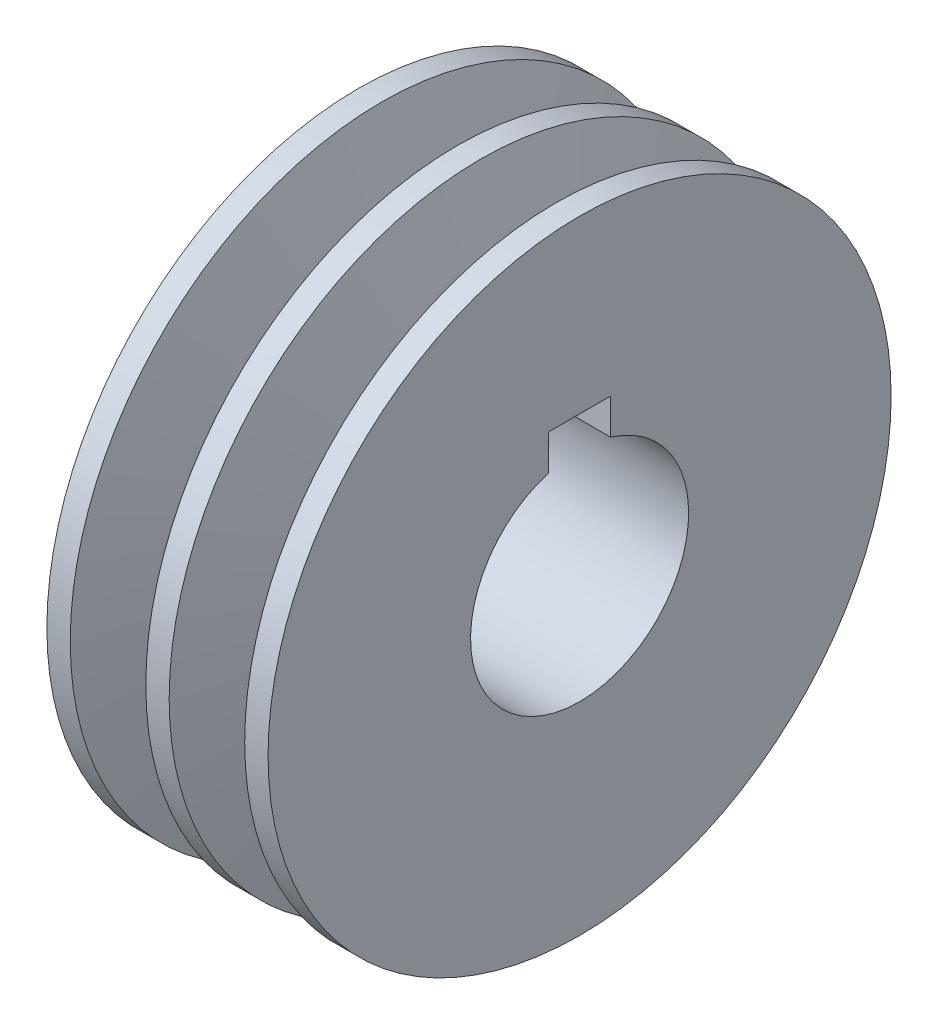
from build123d import *

# Parameters (mm, degrees)
SCHNITT_LINEAR_AUSTRAGEN1_DEPTH = 64.297393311


with BuildPart() as part:
    # Skizze1 → Rotation1 (revolve)
    with BuildSketch(Plane.XY, mode=Mode.PRIVATE) as rotation1_sk:
        Polygon((0, 0), (0, 40), (3, 40), (6.116600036, 27.5), (9.583399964, 27.5), (12.7, 40), (15.7, 40), (18.816600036, 27.5), (22.283399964, 27.5), (25.4, 40), (28.4, 40), (28.4, 0), align=None)
    revolve(rotation1_sk.sketch.rotate(Axis((0, 0, 0), (1, 0, 0)), 90), axis=Axis((0, 0, 0), (1, 0, 0)))

    # Skizze2 → Schnitt-Linear austragen1 (cut, through all)
    with BuildSketch(Plane(origin=(28.4, 0, 0), x_dir=(0, 0, -1), z_dir=(1, 0, 0))):
        with BuildLine():
            ThreePointArc((4, 13.416407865), (0, 14), (-4, 13.416407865))
            Line((-4, 13.416407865), (4, 13.416407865))
        make_face()
        with BuildLine():
            Line((4, 13.416407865), (-4, 13.416407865))
            ThreePointArc((-4, 13.416407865), (-8.366600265, -11.22497216), (14, 0))
            ThreePointArc((14, 0), (11.22497216, 8.366600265), (4, 13.416407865))
        make_face()
        with BuildLine():
            Line((-4, 18), (-4, 13.416407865))
            ThreePointArc((-4, 13.416407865), (0, 14), (4, 13.416407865))
            Line((4, 13.416407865), (4, 18))
            Line((4, 18), (-4, 18))
        make_face()
        with BuildLine():
            ThreePointArc((4, 13.416407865), (0, 14), (-4, 13.416407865))
            Line((-4, 13.416407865), (4, 13.416407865))
        make_face()
        with BuildLine():
            Line((4, 13.416407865), (-4, 13.416407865))
            ThreePointArc((-4, 13.416407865), (-8.366600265, -11.22497216), (14, 0))
            ThreePointArc((14, 0), (11.22497216, 8.366600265), (4, 13.416407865))
        make_face()
    extrude(amount=-SCHNITT_LINEAR_AUSTRAGEN1_DEPTH, mode=Mode.SUBTRACT)


solid = part.part
